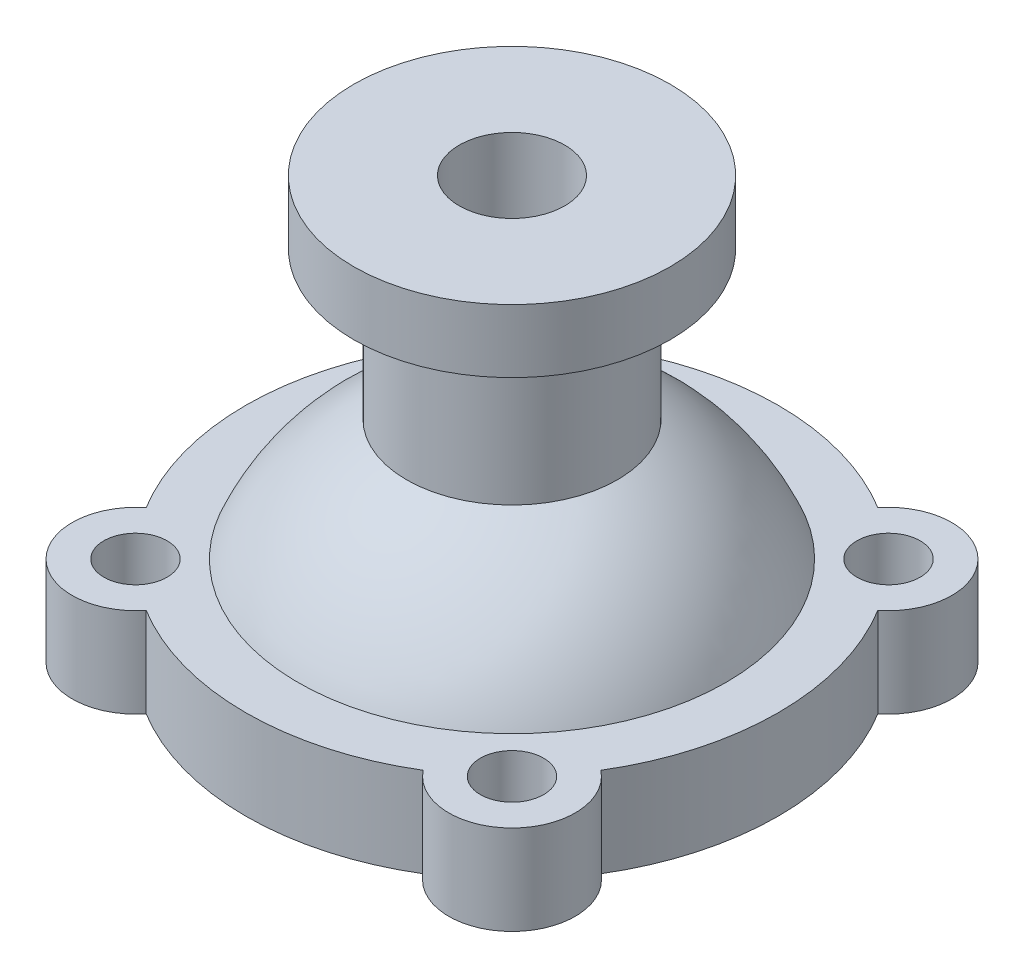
ISO-10303-21;
HEADER;
FILE_DESCRIPTION(('STEP AP214'),'2;1');
FILE_NAME('part.step','',(''),(''),'','','');
FILE_SCHEMA(('AUTOMOTIVE_DESIGN { 1 0 10303 214 1 1 1 1 }'));
ENDSEC;
DATA;
#1=APPLICATION_CONTEXT('core data for automotive mechanical design processes');
#2=APPLICATION_PROTOCOL_DEFINITION('international standard','automotive_design',2000,#1);
#3=PRODUCT_CONTEXT('',#1,'mechanical');
#4=PRODUCT('Part','Part','',(#3));
#5=PRODUCT_RELATED_PRODUCT_CATEGORY('part','',(#4));
#6=PRODUCT_DEFINITION_FORMATION('','',#4);
#7=PRODUCT_DEFINITION_CONTEXT('part definition',#1,'design');
#8=PRODUCT_DEFINITION('design','',#6,#7);
#9=PRODUCT_DEFINITION_SHAPE('','',#8);
#10=(LENGTH_UNIT() NAMED_UNIT(*) SI_UNIT(.MILLI.,.METRE.));
#11=(NAMED_UNIT(*) PLANE_ANGLE_UNIT() SI_UNIT($,.RADIAN.));
#12=(NAMED_UNIT(*) SI_UNIT($,.STERADIAN.) SOLID_ANGLE_UNIT());
#13=UNCERTAINTY_MEASURE_WITH_UNIT(LENGTH_MEASURE(1.E-05),#10,'distance_accuracy_value','');
#14=(GEOMETRIC_REPRESENTATION_CONTEXT(3) GLOBAL_UNCERTAINTY_ASSIGNED_CONTEXT((#13)) GLOBAL_UNIT_ASSIGNED_CONTEXT((#10,
#11,#12)) REPRESENTATION_CONTEXT('',''));
#15=CARTESIAN_POINT('',(0.,0.,0.));
#16=DIRECTION('',(0.,0.,1.));
#17=DIRECTION('',(1.,0.,0.));
#18=AXIS2_PLACEMENT_3D('',#15,#16,#17);
#19=CARTESIAN_POINT('',(0.,0.,0.));
#20=DIRECTION('',(0.,1.,0.));
#21=DIRECTION('',(1.,0.,0.));
#22=AXIS2_PLACEMENT_3D('',#19,#20,#21);
#23=SPHERICAL_SURFACE('',#22,88.);
#24=CARTESIAN_POINT('',(0.,34.,0.));
#25=DIRECTION('',(0.,1.,0.));
#26=DIRECTION('',(-1.,0.,0.));
#27=AXIS2_PLACEMENT_3D('',#24,#25,#26);
#28=CIRCLE('',#27,81.1664955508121);
#29=CARTESIAN_POINT('',(81.1664955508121,34.,0.));
#30=VERTEX_POINT('',#29);
#31=EDGE_CURVE('E204',#30,#30,#28,.T.);
#32=CARTESIAN_POINT('',(0.,80.,0.));
#33=DIRECTION('',(0.,1.,0.));
#34=DIRECTION('',(0.,0.,1.));
#35=AXIS2_PLACEMENT_3D('',#32,#33,#34);
#36=CIRCLE('',#35,36.6606055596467);
#37=CARTESIAN_POINT('',(36.6606055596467,80.,0.));
#38=VERTEX_POINT('',#37);
#39=EDGE_CURVE('E11',#38,#38,#36,.T.);
#40=CARTESIAN_POINT('',(81.1664955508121,34.,0.));
#41=CARTESIAN_POINT('',(80.9028514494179,34.6293883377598,0.));
#42=CARTESIAN_POINT('',(80.6318839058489,35.2557088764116,0.));
#43=CARTESIAN_POINT('',(80.0754547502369,36.5018781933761,0.));
#44=CARTESIAN_POINT('',(79.7899931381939,37.1217269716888,0.));
#45=CARTESIAN_POINT('',(79.2047286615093,38.354616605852,0.));
#46=CARTESIAN_POINT('',(78.9049257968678,38.9676574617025,0.));
#47=CARTESIAN_POINT('',(78.2911414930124,40.1865997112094,0.));
#48=CARTESIAN_POINT('',(77.9771600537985,40.7925011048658,0.));
#49=CARTESIAN_POINT('',(77.3351883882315,41.9968365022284,0.));
#50=CARTESIAN_POINT('',(77.0071981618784,42.5952705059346,0.));
#51=CARTESIAN_POINT('',(76.3373864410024,43.7843473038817,0.));
#52=CARTESIAN_POINT('',(75.9955649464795,44.3749900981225,0.));
#53=CARTESIAN_POINT('',(75.2982756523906,45.5481648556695,0.));
#54=CARTESIAN_POINT('',(74.9428078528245,46.1306968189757,0.));
#55=CARTESIAN_POINT('',(74.2184183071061,47.287334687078,0.));
#56=CARTESIAN_POINT('',(73.8494965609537,47.8614405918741,0.));
#57=CARTESIAN_POINT('',(73.098398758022,49.0009156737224,0.));
#58=CARTESIAN_POINT('',(72.7162227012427,49.5662848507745,0.));
#59=CARTESIAN_POINT('',(71.9388230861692,50.6879805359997,0.));
#60=CARTESIAN_POINT('',(71.5435995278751,51.2443070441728,0.));
#61=CARTESIAN_POINT('',(70.7403187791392,52.3476163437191,0.));
#62=CARTESIAN_POINT('',(70.3322615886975,52.8945991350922,0.));
#63=CARTESIAN_POINT('',(69.5035343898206,53.9789250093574,0.));
#64=CARTESIAN_POINT('',(69.0828643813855,54.5162680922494,0.));
#65=CARTESIAN_POINT('',(68.2291391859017,55.5810237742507,0.));
#66=CARTESIAN_POINT('',(67.7960839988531,56.1084363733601,0.));
#67=CARTESIAN_POINT('',(66.9178227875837,57.1530456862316,0.));
#68=CARTESIAN_POINT('',(66.4726167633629,57.6702423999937,0.));
#69=CARTESIAN_POINT('',(65.5702947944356,58.6941400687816,0.));
#70=CARTESIAN_POINT('',(65.1131788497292,59.2008410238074,0.));
#71=CARTESIAN_POINT('',(64.187284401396,60.2034729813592,0.));
#72=CARTESIAN_POINT('',(63.7185058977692,60.6994039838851,0.));
#73=CARTESIAN_POINT('',(62.7695400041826,61.6802276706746,0.));
#74=CARTESIAN_POINT('',(62.2893526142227,62.1651203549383,0.));
#75=CARTESIAN_POINT('',(61.3178287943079,63.1236050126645,0.));
#76=CARTESIAN_POINT('',(60.8264923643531,63.597196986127,0.));
#77=CARTESIAN_POINT('',(59.8329363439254,64.5328239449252,0.));
#78=CARTESIAN_POINT('',(59.3307167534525,64.9948589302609,0.));
#79=CARTESIAN_POINT('',(58.3156661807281,65.9071218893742,0.));
#80=CARTESIAN_POINT('',(57.8028351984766,66.3573498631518,0.));
#81=CARTESIAN_POINT('',(56.766839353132,67.2457551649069,0.));
#82=CARTESIAN_POINT('',(56.2436744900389,67.6839324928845,0.));
#83=CARTESIAN_POINT('',(55.187293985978,68.5479993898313,0.));
#84=CARTESIAN_POINT('',(54.6540783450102,68.9738889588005,0.));
#85=CARTESIAN_POINT('',(53.5778848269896,69.8131498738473,0.));
#86=CARTESIAN_POINT('',(53.0349069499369,70.226521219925,0.));
#87=CARTESIAN_POINT('',(51.9394827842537,71.0405219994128,0.));
#88=CARTESIAN_POINT('',(51.3870364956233,71.4411514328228,0.));
#89=CARTESIAN_POINT('',(50.2729744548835,72.2294515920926,0.));
#90=CARTESIAN_POINT('',(49.7113587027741,72.6171223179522,0.));
#91=CARTESIAN_POINT('',(48.5792616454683,73.3792952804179,0.));
#92=CARTESIAN_POINT('',(48.0087803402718,73.753797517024,0.));
#93=CARTESIAN_POINT('',(46.8592608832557,74.4894308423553,0.));
#94=CARTESIAN_POINT('',(46.2802227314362,74.8505619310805,0.));
#95=CARTESIAN_POINT('',(45.1139029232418,75.5592575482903,0.));
#96=CARTESIAN_POINT('',(44.526621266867,75.9068220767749,0.));
#97=CARTESIAN_POINT('',(43.3441322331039,76.5881964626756,0.));
#98=CARTESIAN_POINT('',(42.7489248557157,76.9220063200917,0.));
#99=CARTESIAN_POINT('',(41.5509065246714,77.5756908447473,0.));
#100=CARTESIAN_POINT('',(40.9480955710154,77.8955655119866,0.));
#101=CARTESIAN_POINT('',(39.7351960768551,78.5212061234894,0.));
#102=CARTESIAN_POINT('',(39.1251075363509,78.8269720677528,0.));
#103=CARTESIAN_POINT('',(37.8979838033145,79.424231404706,0.));
#104=CARTESIAN_POINT('',(37.2809486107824,79.7157247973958,0.));
#105=CARTESIAN_POINT('',(36.6606055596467,80.,0.));
#106=B_SPLINE_CURVE_WITH_KNOTS('',3,(#40,#41,#42,#43,#44,#45,#46,#47,#48,#49,#50,#51,#52,#53,
#54,#55,#56,#57,#58,#59,#60,#61,#62,#63,#64,#65,#66,#67,#68,#69,#70,#71,#72,#73,#74,#75,#76,#77,
#78,#79,#80,#81,#82,#83,#84,#85,#86,#87,#88,#89,#90,#91,#92,#93,#94,#95,#96,#97,#98,#99,#100,
#101,#102,#103,#104,#105),.UNSPECIFIED.,.F.,.F.,(4,2,2,2,2,2,2,2,2,2,2,2,2,2,2,2,2,2,2,2,2,2,2,
2,2,2,2,2,2,2,2,2,4),(0.,2.04708368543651,4.09416737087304,6.14125105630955,8.18833474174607,
10.2354184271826,12.2825021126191,14.3295857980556,16.3766694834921,18.4237531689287,
20.4708368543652,22.5179205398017,24.5650042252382,26.6120879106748,28.6591715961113,
30.7062552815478,32.7533389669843,34.8004226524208,36.8475063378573,38.8945900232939,
40.9416737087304,42.9887573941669,45.0358410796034,47.0829247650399,49.1300084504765,
51.177092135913,53.2241758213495,55.271259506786,57.3183431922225,59.3654268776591,
61.4125105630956,63.4595942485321,65.5066779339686),.UNSPECIFIED.);
#107=EDGE_CURVE('BSEAM31',#30,#38,#106,.T.);
#108=ORIENTED_EDGE('',*,*,#31,.T.);
#109=ORIENTED_EDGE('',*,*,#39,.F.);
#110=ORIENTED_EDGE('',*,*,#107,.T.);
#111=ORIENTED_EDGE('',*,*,#107,.F.);
#112=EDGE_LOOP('',(#108,#110,#109,#111));
#113=FACE_BOUND('',#112,.T.);
#114=ADVANCED_FACE('F31',(#113),#23,.T.);
#115=CARTESIAN_POINT('',(0.,0.,0.));
#116=DIRECTION('',(0.,1.,0.));
#117=DIRECTION('',(1.,0.,0.));
#118=AXIS2_PLACEMENT_3D('',#115,#116,#117);
#119=SPHERICAL_SURFACE('',#118,74.);
#120=CARTESIAN_POINT('',(0.,71.2460525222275,0.));
#121=DIRECTION('',(0.,-1.,0.));
#122=DIRECTION('',(0.,0.,-1.));
#123=AXIS2_PLACEMENT_3D('',#120,#121,#122);
#124=CIRCLE('',#123,20.);
#125=CARTESIAN_POINT('',(0.,71.2460525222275,-20.));
#126=VERTEX_POINT('',#125);
#127=EDGE_CURVE('E222',#126,#126,#124,.F.);
#128=ORIENTED_EDGE('',*,*,#127,.T.);
#129=EDGE_LOOP('',(#128));
#130=FACE_BOUND('',#129,.T.);
#131=CARTESIAN_POINT('',(0.,0.,0.));
#132=DIRECTION('',(0.,1.,0.));
#133=DIRECTION('',(0.,0.,1.));
#134=AXIS2_PLACEMENT_3D('',#131,#132,#133);
#135=CIRCLE('',#134,74.);
#136=CARTESIAN_POINT('',(0.,0.,74.));
#137=VERTEX_POINT('',#136);
#138=EDGE_CURVE('E209',#137,#137,#135,.T.);
#139=ORIENTED_EDGE('',*,*,#138,.F.);
#140=EDGE_LOOP('',(#139));
#141=FACE_BOUND('',#140,.T.);
#142=ADVANCED_FACE('F266',(#130,#141),#119,.F.);
#143=CARTESIAN_POINT('',(35.7088924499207,0.,-35.7088924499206));
#144=DIRECTION('',(0.,1.,0.));
#145=DIRECTION('',(0.,0.,1.));
#146=AXIS2_PLACEMENT_3D('',#143,#144,#145);
#147=PLANE('',#146);
#148=CARTESIAN_POINT('',(-71.4177848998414,0.,71.4177848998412));
#149=DIRECTION('',(0.,1.,0.));
#150=DIRECTION('',(0.,0.,1.));
#151=AXIS2_PLACEMENT_3D('',#148,#149,#150);
#152=CIRCLE('',#151,12.);
#153=CARTESIAN_POINT('',(-71.4177848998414,0.,83.4177848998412));
#154=VERTEX_POINT('',#153);
#155=EDGE_CURVE('E201',#154,#154,#152,.T.);
#156=ORIENTED_EDGE('',*,*,#155,.T.);
#157=EDGE_LOOP('',(#156));
#158=FACE_BOUND('',#157,.T.);
#159=CARTESIAN_POINT('',(71.4177848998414,0.,-71.4177848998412));
#160=DIRECTION('',(0.,1.,0.));
#161=DIRECTION('',(0.,0.,1.));
#162=AXIS2_PLACEMENT_3D('',#159,#160,#161);
#163=CIRCLE('',#162,12.);
#164=CARTESIAN_POINT('',(71.4177848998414,0.,-59.4177848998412));
#165=VERTEX_POINT('',#164);
#166=EDGE_CURVE('E189',#165,#165,#163,.T.);
#167=ORIENTED_EDGE('',*,*,#166,.T.);
#168=EDGE_LOOP('',(#167));
#169=FACE_BOUND('',#168,.T.);
#170=CARTESIAN_POINT('',(0.,0.,0.));
#171=DIRECTION('',(0.,1.,0.));
#172=DIRECTION('',(0.,0.,1.));
#173=AXIS2_PLACEMENT_3D('',#170,#171,#172);
#174=CIRCLE('',#173,101.);
#175=CARTESIAN_POINT('',(86.2518369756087,0.,52.5511238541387));
#176=VERTEX_POINT('',#175);
#177=CARTESIAN_POINT('',(86.2518369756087,0.,-52.5511238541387));
#178=VERTEX_POINT('',#177);
#179=EDGE_CURVE('E130',#176,#178,#174,.T.);
#180=ORIENTED_EDGE('',*,*,#179,.F.);
#181=CARTESIAN_POINT('',(71.4177848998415,0.,71.4177848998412));
#182=DIRECTION('',(0.,1.,0.));
#183=DIRECTION('',(0.,0.,1.));
#184=AXIS2_PLACEMENT_3D('',#181,#182,#183);
#185=CIRCLE('',#184,24.);
#186=CARTESIAN_POINT('',(52.551123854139,0.,86.2518369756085));
#187=VERTEX_POINT('',#186);
#188=EDGE_CURVE('E83',#187,#176,#185,.T.);
#189=ORIENTED_EDGE('',*,*,#188,.F.);
#190=CARTESIAN_POINT('',(0.,0.,0.));
#191=DIRECTION('',(0.,1.,0.));
#192=DIRECTION('',(0.,0.,1.));
#193=AXIS2_PLACEMENT_3D('',#190,#191,#192);
#194=CIRCLE('',#193,101.);
#195=CARTESIAN_POINT('',(-52.551123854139,0.,86.2518369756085));
#196=VERTEX_POINT('',#195);
#197=EDGE_CURVE('E77',#196,#187,#194,.T.);
#198=ORIENTED_EDGE('',*,*,#197,.F.);
#199=CARTESIAN_POINT('',(-71.4177848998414,0.,71.4177848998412));
#200=DIRECTION('',(0.,1.,0.));
#201=DIRECTION('',(0.,0.,1.));
#202=AXIS2_PLACEMENT_3D('',#199,#200,#201);
#203=CIRCLE('',#202,24.);
#204=CARTESIAN_POINT('',(-86.2518369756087,0.,52.5511238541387));
#205=VERTEX_POINT('',#204);
#206=EDGE_CURVE('E120',#205,#196,#203,.T.);
#207=ORIENTED_EDGE('',*,*,#206,.F.);
#208=CARTESIAN_POINT('',(0.,0.,0.));
#209=DIRECTION('',(0.,1.,0.));
#210=DIRECTION('',(0.,0.,1.));
#211=AXIS2_PLACEMENT_3D('',#208,#209,#210);
#212=CIRCLE('',#211,101.);
#213=CARTESIAN_POINT('',(-86.2518369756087,0.,-52.5511238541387));
#214=VERTEX_POINT('',#213);
#215=EDGE_CURVE('E140',#214,#205,#212,.T.);
#216=ORIENTED_EDGE('',*,*,#215,.F.);
#217=CARTESIAN_POINT('',(-71.4177848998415,0.,-71.4177848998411));
#218=DIRECTION('',(0.,1.,0.));
#219=DIRECTION('',(0.,0.,1.));
#220=AXIS2_PLACEMENT_3D('',#217,#218,#219);
#221=CIRCLE('',#220,24.);
#222=CARTESIAN_POINT('',(-52.5511238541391,0.,-86.2518369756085));
#223=VERTEX_POINT('',#222);
#224=EDGE_CURVE('E138',#223,#214,#221,.T.);
#225=ORIENTED_EDGE('',*,*,#224,.F.);
#226=CARTESIAN_POINT('',(0.,0.,0.));
#227=DIRECTION('',(0.,1.,0.));
#228=DIRECTION('',(0.,0.,1.));
#229=AXIS2_PLACEMENT_3D('',#226,#227,#228);
#230=CIRCLE('',#229,101.);
#231=CARTESIAN_POINT('',(52.551123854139,0.,-86.2518369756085));
#232=VERTEX_POINT('',#231);
#233=EDGE_CURVE('E136',#232,#223,#230,.T.);
#234=ORIENTED_EDGE('',*,*,#233,.F.);
#235=CARTESIAN_POINT('',(71.4177848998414,0.,-71.4177848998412));
#236=DIRECTION('',(0.,1.,0.));
#237=DIRECTION('',(0.,0.,1.));
#238=AXIS2_PLACEMENT_3D('',#235,#236,#237);
#239=CIRCLE('',#238,24.);
#240=EDGE_CURVE('E133',#178,#232,#239,.T.);
#241=ORIENTED_EDGE('',*,*,#240,.F.);
#242=EDGE_LOOP('',(#180,#189,#198,#207,#216,#225,#234,#241));
#243=FACE_BOUND('',#242,.T.);
#244=CARTESIAN_POINT('',(-71.4177848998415,0.,-71.4177848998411));
#245=DIRECTION('',(0.,1.,0.));
#246=DIRECTION('',(0.,0.,1.));
#247=AXIS2_PLACEMENT_3D('',#244,#245,#246);
#248=CIRCLE('',#247,12.);
#249=CARTESIAN_POINT('',(-71.4177848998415,0.,-59.4177848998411));
#250=VERTEX_POINT('',#249);
#251=EDGE_CURVE('E183',#250,#250,#248,.T.);
#252=ORIENTED_EDGE('',*,*,#251,.T.);
#253=EDGE_LOOP('',(#252));
#254=FACE_BOUND('',#253,.T.);
#255=CARTESIAN_POINT('',(71.4177848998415,0.,71.4177848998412));
#256=DIRECTION('',(0.,1.,0.));
#257=DIRECTION('',(0.,0.,1.));
#258=AXIS2_PLACEMENT_3D('',#255,#256,#257);
#259=CIRCLE('',#258,12.);
#260=CARTESIAN_POINT('',(71.4177848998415,0.,83.4177848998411));
#261=VERTEX_POINT('',#260);
#262=EDGE_CURVE('E195',#261,#261,#259,.T.);
#263=ORIENTED_EDGE('',*,*,#262,.T.);
#264=EDGE_LOOP('',(#263));
#265=FACE_BOUND('',#264,.T.);
#266=ORIENTED_EDGE('',*,*,#138,.T.);
#267=EDGE_LOOP('',(#266));
#268=FACE_BOUND('',#267,.T.);
#269=ADVANCED_FACE('F163',(#158,#169,#243,#254,#265,#268),#147,.F.);
#270=CARTESIAN_POINT('',(35.7088924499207,34.,-35.7088924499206));
#271=DIRECTION('',(0.,1.,0.));
#272=DIRECTION('',(0.,0.,1.));
#273=AXIS2_PLACEMENT_3D('',#270,#271,#272);
#274=PLANE('',#273);
#275=CARTESIAN_POINT('',(-71.4177848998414,34.,71.4177848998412));
#276=DIRECTION('',(0.,1.,0.));
#277=DIRECTION('',(0.,0.,1.));
#278=AXIS2_PLACEMENT_3D('',#275,#276,#277);
#279=CIRCLE('',#278,12.);
#280=CARTESIAN_POINT('',(-71.4177848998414,34.,83.4177848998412));
#281=VERTEX_POINT('',#280);
#282=EDGE_CURVE('E198',#281,#281,#279,.T.);
#283=ORIENTED_EDGE('',*,*,#282,.F.);
#284=EDGE_LOOP('',(#283));
#285=FACE_BOUND('',#284,.T.);
#286=CARTESIAN_POINT('',(71.4177848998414,34.,-71.4177848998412));
#287=DIRECTION('',(0.,1.,0.));
#288=DIRECTION('',(0.,0.,1.));
#289=AXIS2_PLACEMENT_3D('',#286,#287,#288);
#290=CIRCLE('',#289,12.);
#291=CARTESIAN_POINT('',(71.4177848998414,34.,-59.4177848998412));
#292=VERTEX_POINT('',#291);
#293=EDGE_CURVE('E186',#292,#292,#290,.T.);
#294=ORIENTED_EDGE('',*,*,#293,.F.);
#295=EDGE_LOOP('',(#294));
#296=FACE_BOUND('',#295,.T.);
#297=CARTESIAN_POINT('',(0.,34.,0.));
#298=DIRECTION('',(0.,1.,0.));
#299=DIRECTION('',(0.,0.,1.));
#300=AXIS2_PLACEMENT_3D('',#297,#298,#299);
#301=CIRCLE('',#300,101.);
#302=CARTESIAN_POINT('',(86.2518369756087,34.,52.5511238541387));
#303=VERTEX_POINT('',#302);
#304=CARTESIAN_POINT('',(86.2518369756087,34.,-52.5511238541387));
#305=VERTEX_POINT('',#304);
#306=EDGE_CURVE('E145',#303,#305,#301,.T.);
#307=ORIENTED_EDGE('',*,*,#306,.T.);
#308=CARTESIAN_POINT('',(71.4177848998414,34.,-71.4177848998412));
#309=DIRECTION('',(0.,1.,0.));
#310=DIRECTION('',(0.,0.,1.));
#311=AXIS2_PLACEMENT_3D('',#308,#309,#310);
#312=CIRCLE('',#311,24.);
#313=CARTESIAN_POINT('',(52.551123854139,34.,-86.2518369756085));
#314=VERTEX_POINT('',#313);
#315=EDGE_CURVE('E92',#305,#314,#312,.T.);
#316=ORIENTED_EDGE('',*,*,#315,.T.);
#317=CARTESIAN_POINT('',(0.,34.,0.));
#318=DIRECTION('',(0.,1.,0.));
#319=DIRECTION('',(0.,0.,1.));
#320=AXIS2_PLACEMENT_3D('',#317,#318,#319);
#321=CIRCLE('',#320,101.);
#322=CARTESIAN_POINT('',(-52.5511238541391,34.,-86.2518369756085));
#323=VERTEX_POINT('',#322);
#324=EDGE_CURVE('E177',#314,#323,#321,.T.);
#325=ORIENTED_EDGE('',*,*,#324,.T.);
#326=CARTESIAN_POINT('',(-71.4177848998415,34.,-71.4177848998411));
#327=DIRECTION('',(0.,1.,0.));
#328=DIRECTION('',(0.,0.,1.));
#329=AXIS2_PLACEMENT_3D('',#326,#327,#328);
#330=CIRCLE('',#329,24.);
#331=CARTESIAN_POINT('',(-86.2518369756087,34.,-52.5511238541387));
#332=VERTEX_POINT('',#331);
#333=EDGE_CURVE('E176',#323,#332,#330,.T.);
#334=ORIENTED_EDGE('',*,*,#333,.T.);
#335=CARTESIAN_POINT('',(0.,34.,0.));
#336=DIRECTION('',(0.,1.,0.));
#337=DIRECTION('',(0.,0.,1.));
#338=AXIS2_PLACEMENT_3D('',#335,#336,#337);
#339=CIRCLE('',#338,101.);
#340=CARTESIAN_POINT('',(-86.2518369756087,34.,52.5511238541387));
#341=VERTEX_POINT('',#340);
#342=EDGE_CURVE('E112',#332,#341,#339,.T.);
#343=ORIENTED_EDGE('',*,*,#342,.T.);
#344=CARTESIAN_POINT('',(-71.4177848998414,34.,71.4177848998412));
#345=DIRECTION('',(0.,1.,0.));
#346=DIRECTION('',(0.,0.,1.));
#347=AXIS2_PLACEMENT_3D('',#344,#345,#346);
#348=CIRCLE('',#347,24.);
#349=CARTESIAN_POINT('',(-52.551123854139,34.,86.2518369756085));
#350=VERTEX_POINT('',#349);
#351=EDGE_CURVE('E105',#341,#350,#348,.T.);
#352=ORIENTED_EDGE('',*,*,#351,.T.);
#353=CARTESIAN_POINT('',(0.,34.,0.));
#354=DIRECTION('',(0.,1.,0.));
#355=DIRECTION('',(0.,0.,1.));
#356=AXIS2_PLACEMENT_3D('',#353,#354,#355);
#357=CIRCLE('',#356,101.);
#358=CARTESIAN_POINT('',(52.551123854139,34.,86.2518369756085));
#359=VERTEX_POINT('',#358);
#360=EDGE_CURVE('E110',#350,#359,#357,.T.);
#361=ORIENTED_EDGE('',*,*,#360,.T.);
#362=CARTESIAN_POINT('',(71.4177848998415,34.,71.4177848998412));
#363=DIRECTION('',(0.,1.,0.));
#364=DIRECTION('',(0.,0.,1.));
#365=AXIS2_PLACEMENT_3D('',#362,#363,#364);
#366=CIRCLE('',#365,24.);
#367=EDGE_CURVE('E48',#359,#303,#366,.T.);
#368=ORIENTED_EDGE('',*,*,#367,.T.);
#369=EDGE_LOOP('',(#307,#316,#325,#334,#343,#352,#361,#368));
#370=FACE_BOUND('',#369,.T.);
#371=CARTESIAN_POINT('',(-71.4177848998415,34.,-71.4177848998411));
#372=DIRECTION('',(0.,1.,0.));
#373=DIRECTION('',(0.,0.,1.));
#374=AXIS2_PLACEMENT_3D('',#371,#372,#373);
#375=CIRCLE('',#374,12.);
#376=CARTESIAN_POINT('',(-71.4177848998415,34.,-59.4177848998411));
#377=VERTEX_POINT('',#376);
#378=EDGE_CURVE('E134',#377,#377,#375,.T.);
#379=ORIENTED_EDGE('',*,*,#378,.F.);
#380=EDGE_LOOP('',(#379));
#381=FACE_BOUND('',#380,.T.);
#382=CARTESIAN_POINT('',(71.4177848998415,34.,71.4177848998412));
#383=DIRECTION('',(0.,1.,0.));
#384=DIRECTION('',(0.,0.,1.));
#385=AXIS2_PLACEMENT_3D('',#382,#383,#384);
#386=CIRCLE('',#385,12.);
#387=CARTESIAN_POINT('',(71.4177848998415,34.,83.4177848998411));
#388=VERTEX_POINT('',#387);
#389=EDGE_CURVE('E192',#388,#388,#386,.T.);
#390=ORIENTED_EDGE('',*,*,#389,.F.);
#391=EDGE_LOOP('',(#390));
#392=FACE_BOUND('',#391,.T.);
#393=ORIENTED_EDGE('',*,*,#31,.F.);
#394=EDGE_LOOP('',(#393));
#395=FACE_BOUND('',#394,.T.);
#396=ADVANCED_FACE('F107',(#285,#296,#370,#381,#392,#395),#274,.T.);
#397=CARTESIAN_POINT('',(0.,34.,0.));
#398=DIRECTION('',(0.,-1.,0.));
#399=DIRECTION('',(0.,0.,-1.));
#400=AXIS2_PLACEMENT_3D('',#397,#398,#399);
#401=CYLINDRICAL_SURFACE('',#400,101.);
#402=ORIENTED_EDGE('',*,*,#179,.T.);
#403=DIRECTION('',(0.,-1.,0.));
#404=VECTOR('',#403,1.);
#405=CARTESIAN_POINT('',(86.2518369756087,34.,-52.5511238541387));
#406=LINE('',#405,#404);
#407=EDGE_CURVE('E40',#305,#178,#406,.T.);
#408=ORIENTED_EDGE('',*,*,#407,.F.);
#409=ORIENTED_EDGE('',*,*,#306,.F.);
#410=DIRECTION('',(0.,-1.,0.));
#411=VECTOR('',#410,1.);
#412=CARTESIAN_POINT('',(86.2518369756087,34.,52.5511238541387));
#413=LINE('',#412,#411);
#414=EDGE_CURVE('E126',#303,#176,#413,.T.);
#415=ORIENTED_EDGE('',*,*,#414,.T.);
#416=EDGE_LOOP('',(#402,#408,#409,#415));
#417=FACE_BOUND('',#416,.T.);
#418=ADVANCED_FACE('F33',(#417),#401,.T.);
#419=CARTESIAN_POINT('',(71.4177848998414,34.,-71.4177848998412));
#420=DIRECTION('',(0.,-1.,0.));
#421=DIRECTION('',(0.,0.,-1.));
#422=AXIS2_PLACEMENT_3D('',#419,#420,#421);
#423=CYLINDRICAL_SURFACE('',#422,24.);
#424=ORIENTED_EDGE('',*,*,#240,.T.);
#425=DIRECTION('',(0.,-1.,0.));
#426=VECTOR('',#425,1.);
#427=CARTESIAN_POINT('',(52.551123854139,34.,-86.2518369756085));
#428=LINE('',#427,#426);
#429=EDGE_CURVE('E155',#314,#232,#428,.T.);
#430=ORIENTED_EDGE('',*,*,#429,.F.);
#431=ORIENTED_EDGE('',*,*,#315,.F.);
#432=ORIENTED_EDGE('',*,*,#407,.T.);
#433=EDGE_LOOP('',(#424,#430,#431,#432));
#434=FACE_BOUND('',#433,.T.);
#435=ADVANCED_FACE('F158',(#434),#423,.T.);
#436=CARTESIAN_POINT('',(0.,34.,0.));
#437=DIRECTION('',(0.,-1.,0.));
#438=DIRECTION('',(0.,0.,-1.));
#439=AXIS2_PLACEMENT_3D('',#436,#437,#438);
#440=CYLINDRICAL_SURFACE('',#439,101.);
#441=ORIENTED_EDGE('',*,*,#233,.T.);
#442=DIRECTION('',(0.,-1.,0.));
#443=VECTOR('',#442,1.);
#444=CARTESIAN_POINT('',(-52.5511238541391,34.,-86.2518369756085));
#445=LINE('',#444,#443);
#446=EDGE_CURVE('E152',#323,#223,#445,.T.);
#447=ORIENTED_EDGE('',*,*,#446,.F.);
#448=ORIENTED_EDGE('',*,*,#324,.F.);
#449=ORIENTED_EDGE('',*,*,#429,.T.);
#450=EDGE_LOOP('',(#441,#447,#448,#449));
#451=FACE_BOUND('',#450,.T.);
#452=ADVANCED_FACE('F170',(#451),#440,.T.);
#453=CARTESIAN_POINT('',(-71.4177848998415,34.,-71.4177848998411));
#454=DIRECTION('',(0.,-1.,0.));
#455=DIRECTION('',(0.,0.,-1.));
#456=AXIS2_PLACEMENT_3D('',#453,#454,#455);
#457=CYLINDRICAL_SURFACE('',#456,24.);
#458=ORIENTED_EDGE('',*,*,#224,.T.);
#459=DIRECTION('',(0.,-1.,0.));
#460=VECTOR('',#459,1.);
#461=CARTESIAN_POINT('',(-86.2518369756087,34.,-52.5511238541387));
#462=LINE('',#461,#460);
#463=EDGE_CURVE('E149',#332,#214,#462,.T.);
#464=ORIENTED_EDGE('',*,*,#463,.F.);
#465=ORIENTED_EDGE('',*,*,#333,.F.);
#466=ORIENTED_EDGE('',*,*,#446,.T.);
#467=EDGE_LOOP('',(#458,#464,#465,#466));
#468=FACE_BOUND('',#467,.T.);
#469=ADVANCED_FACE('F174',(#468),#457,.T.);
#470=CARTESIAN_POINT('',(0.,34.,0.));
#471=DIRECTION('',(0.,-1.,0.));
#472=DIRECTION('',(0.,0.,-1.));
#473=AXIS2_PLACEMENT_3D('',#470,#471,#472);
#474=CYLINDRICAL_SURFACE('',#473,101.);
#475=ORIENTED_EDGE('',*,*,#215,.T.);
#476=DIRECTION('',(0.,-1.,0.));
#477=VECTOR('',#476,1.);
#478=CARTESIAN_POINT('',(-86.2518369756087,34.,52.5511238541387));
#479=LINE('',#478,#477);
#480=EDGE_CURVE('E121',#341,#205,#479,.T.);
#481=ORIENTED_EDGE('',*,*,#480,.F.);
#482=ORIENTED_EDGE('',*,*,#342,.F.);
#483=ORIENTED_EDGE('',*,*,#463,.T.);
#484=EDGE_LOOP('',(#475,#481,#482,#483));
#485=FACE_BOUND('',#484,.T.);
#486=ADVANCED_FACE('F303',(#485),#474,.T.);
#487=CARTESIAN_POINT('',(-71.4177848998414,34.,71.4177848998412));
#488=DIRECTION('',(0.,-1.,0.));
#489=DIRECTION('',(0.,0.,-1.));
#490=AXIS2_PLACEMENT_3D('',#487,#488,#489);
#491=CYLINDRICAL_SURFACE('',#490,24.);
#492=ORIENTED_EDGE('',*,*,#206,.T.);
#493=DIRECTION('',(0.,-1.,0.));
#494=VECTOR('',#493,1.);
#495=CARTESIAN_POINT('',(-52.551123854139,34.,86.2518369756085));
#496=LINE('',#495,#494);
#497=EDGE_CURVE('E117',#350,#196,#496,.T.);
#498=ORIENTED_EDGE('',*,*,#497,.F.);
#499=ORIENTED_EDGE('',*,*,#351,.F.);
#500=ORIENTED_EDGE('',*,*,#480,.T.);
#501=EDGE_LOOP('',(#492,#498,#499,#500));
#502=FACE_BOUND('',#501,.T.);
#503=ADVANCED_FACE('F118',(#502),#491,.T.);
#504=CARTESIAN_POINT('',(0.,34.,0.));
#505=DIRECTION('',(0.,-1.,0.));
#506=DIRECTION('',(0.,0.,-1.));
#507=AXIS2_PLACEMENT_3D('',#504,#505,#506);
#508=CYLINDRICAL_SURFACE('',#507,101.);
#509=ORIENTED_EDGE('',*,*,#197,.T.);
#510=DIRECTION('',(0.,-1.,0.));
#511=VECTOR('',#510,1.);
#512=CARTESIAN_POINT('',(52.551123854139,34.,86.2518369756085));
#513=LINE('',#512,#511);
#514=EDGE_CURVE('E122',#359,#187,#513,.T.);
#515=ORIENTED_EDGE('',*,*,#514,.F.);
#516=ORIENTED_EDGE('',*,*,#360,.F.);
#517=ORIENTED_EDGE('',*,*,#497,.T.);
#518=EDGE_LOOP('',(#509,#515,#516,#517));
#519=FACE_BOUND('',#518,.T.);
#520=ADVANCED_FACE('F124',(#519),#508,.T.);
#521=CARTESIAN_POINT('',(71.4177848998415,34.,71.4177848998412));
#522=DIRECTION('',(0.,-1.,0.));
#523=DIRECTION('',(0.,0.,-1.));
#524=AXIS2_PLACEMENT_3D('',#521,#522,#523);
#525=CYLINDRICAL_SURFACE('',#524,24.);
#526=ORIENTED_EDGE('',*,*,#188,.T.);
#527=ORIENTED_EDGE('',*,*,#414,.F.);
#528=ORIENTED_EDGE('',*,*,#367,.F.);
#529=ORIENTED_EDGE('',*,*,#514,.T.);
#530=EDGE_LOOP('',(#526,#527,#528,#529));
#531=FACE_BOUND('',#530,.T.);
#532=ADVANCED_FACE('F289',(#531),#525,.T.);
#533=CARTESIAN_POINT('',(-71.4177848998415,34.,-71.4177848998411));
#534=DIRECTION('',(0.,-1.,0.));
#535=DIRECTION('',(0.,0.,-1.));
#536=AXIS2_PLACEMENT_3D('',#533,#534,#535);
#537=CYLINDRICAL_SURFACE('',#536,12.);
#538=ORIENTED_EDGE('',*,*,#378,.T.);
#539=EDGE_LOOP('',(#538));
#540=FACE_BOUND('',#539,.T.);
#541=ORIENTED_EDGE('',*,*,#251,.F.);
#542=EDGE_LOOP('',(#541));
#543=FACE_BOUND('',#542,.T.);
#544=ADVANCED_FACE('F285',(#540,#543),#537,.F.);
#545=CARTESIAN_POINT('',(71.4177848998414,34.,-71.4177848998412));
#546=DIRECTION('',(0.,-1.,0.));
#547=DIRECTION('',(0.,0.,-1.));
#548=AXIS2_PLACEMENT_3D('',#545,#546,#547);
#549=CYLINDRICAL_SURFACE('',#548,12.);
#550=ORIENTED_EDGE('',*,*,#293,.T.);
#551=EDGE_LOOP('',(#550));
#552=FACE_BOUND('',#551,.T.);
#553=ORIENTED_EDGE('',*,*,#166,.F.);
#554=EDGE_LOOP('',(#553));
#555=FACE_BOUND('',#554,.T.);
#556=ADVANCED_FACE('F281',(#552,#555),#549,.F.);
#557=CARTESIAN_POINT('',(71.4177848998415,34.,71.4177848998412));
#558=DIRECTION('',(0.,-1.,0.));
#559=DIRECTION('',(0.,0.,-1.));
#560=AXIS2_PLACEMENT_3D('',#557,#558,#559);
#561=CYLINDRICAL_SURFACE('',#560,12.);
#562=ORIENTED_EDGE('',*,*,#389,.T.);
#563=EDGE_LOOP('',(#562));
#564=FACE_BOUND('',#563,.T.);
#565=ORIENTED_EDGE('',*,*,#262,.F.);
#566=EDGE_LOOP('',(#565));
#567=FACE_BOUND('',#566,.T.);
#568=ADVANCED_FACE('F277',(#564,#567),#561,.F.);
#569=CARTESIAN_POINT('',(-71.4177848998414,34.,71.4177848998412));
#570=DIRECTION('',(0.,-1.,0.));
#571=DIRECTION('',(0.,0.,-1.));
#572=AXIS2_PLACEMENT_3D('',#569,#570,#571);
#573=CYLINDRICAL_SURFACE('',#572,12.);
#574=ORIENTED_EDGE('',*,*,#282,.T.);
#575=EDGE_LOOP('',(#574));
#576=FACE_BOUND('',#575,.T.);
#577=ORIENTED_EDGE('',*,*,#155,.F.);
#578=EDGE_LOOP('',(#577));
#579=FACE_BOUND('',#578,.T.);
#580=ADVANCED_FACE('F261',(#576,#579),#573,.F.);
#581=CARTESIAN_POINT('',(0.,80.,0.));
#582=DIRECTION('',(0.,1.,0.));
#583=DIRECTION('',(0.,0.,1.));
#584=AXIS2_PLACEMENT_3D('',#581,#582,#583);
#585=PLANE('',#584);
#586=CARTESIAN_POINT('',(0.,80.,0.));
#587=DIRECTION('',(0.,1.,0.));
#588=DIRECTION('',(0.,0.,1.));
#589=AXIS2_PLACEMENT_3D('',#586,#587,#588);
#590=CIRCLE('',#589,40.);
#591=CARTESIAN_POINT('',(0.,80.,40.));
#592=VERTEX_POINT('',#591);
#593=EDGE_CURVE('E213',#592,#592,#590,.T.);
#594=ORIENTED_EDGE('',*,*,#593,.F.);
#595=EDGE_LOOP('',(#594));
#596=FACE_BOUND('',#595,.T.);
#597=ORIENTED_EDGE('',*,*,#39,.T.);
#598=EDGE_LOOP('',(#597));
#599=FACE_BOUND('',#598,.T.);
#600=ADVANCED_FACE('F255',(#596,#599),#585,.F.);
#601=CARTESIAN_POINT('',(0.,136.,0.));
#602=DIRECTION('',(0.,-1.,0.));
#603=DIRECTION('',(0.,0.,-1.));
#604=AXIS2_PLACEMENT_3D('',#601,#602,#603);
#605=CYLINDRICAL_SURFACE('',#604,40.);
#606=CARTESIAN_POINT('',(0.,136.,0.));
#607=DIRECTION('',(0.,1.,0.));
#608=DIRECTION('',(0.,0.,1.));
#609=AXIS2_PLACEMENT_3D('',#606,#607,#608);
#610=CIRCLE('',#609,40.);
#611=CARTESIAN_POINT('',(0.,136.,40.));
#612=VERTEX_POINT('',#611);
#613=EDGE_CURVE('E212',#612,#612,#610,.T.);
#614=ORIENTED_EDGE('',*,*,#613,.F.);
#615=EDGE_LOOP('',(#614));
#616=FACE_BOUND('',#615,.T.);
#617=ORIENTED_EDGE('',*,*,#593,.T.);
#618=EDGE_LOOP('',(#617));
#619=FACE_BOUND('',#618,.T.);
#620=ADVANCED_FACE('F249',(#616,#619),#605,.T.);
#621=CARTESIAN_POINT('',(0.,136.,0.));
#622=DIRECTION('',(0.,1.,0.));
#623=DIRECTION('',(0.,0.,1.));
#624=AXIS2_PLACEMENT_3D('',#621,#622,#623);
#625=PLANE('',#624);
#626=CARTESIAN_POINT('',(0.,136.,0.));
#627=DIRECTION('',(0.,1.,0.));
#628=DIRECTION('',(0.,0.,1.));
#629=AXIS2_PLACEMENT_3D('',#626,#627,#628);
#630=CIRCLE('',#629,60.);
#631=CARTESIAN_POINT('',(0.,136.,60.));
#632=VERTEX_POINT('',#631);
#633=EDGE_CURVE('E219',#632,#632,#630,.T.);
#634=ORIENTED_EDGE('',*,*,#633,.F.);
#635=EDGE_LOOP('',(#634));
#636=FACE_BOUND('',#635,.T.);
#637=ORIENTED_EDGE('',*,*,#613,.T.);
#638=EDGE_LOOP('',(#637));
#639=FACE_BOUND('',#638,.T.);
#640=ADVANCED_FACE('F243',(#636,#639),#625,.F.);
#641=CARTESIAN_POINT('',(0.,160.,0.));
#642=DIRECTION('',(0.,-1.,0.));
#643=DIRECTION('',(0.,0.,-1.));
#644=AXIS2_PLACEMENT_3D('',#641,#642,#643);
#645=CYLINDRICAL_SURFACE('',#644,60.);
#646=CARTESIAN_POINT('',(0.,160.,0.));
#647=DIRECTION('',(0.,1.,0.));
#648=DIRECTION('',(0.,0.,1.));
#649=AXIS2_PLACEMENT_3D('',#646,#647,#648);
#650=CIRCLE('',#649,60.);
#651=CARTESIAN_POINT('',(0.,160.,60.));
#652=VERTEX_POINT('',#651);
#653=EDGE_CURVE('E216',#652,#652,#650,.T.);
#654=ORIENTED_EDGE('',*,*,#653,.F.);
#655=EDGE_LOOP('',(#654));
#656=FACE_BOUND('',#655,.T.);
#657=ORIENTED_EDGE('',*,*,#633,.T.);
#658=EDGE_LOOP('',(#657));
#659=FACE_BOUND('',#658,.T.);
#660=ADVANCED_FACE('F237',(#656,#659),#645,.T.);
#661=CARTESIAN_POINT('',(0.,160.,0.));
#662=DIRECTION('',(0.,1.,0.));
#663=DIRECTION('',(0.,0.,1.));
#664=AXIS2_PLACEMENT_3D('',#661,#662,#663);
#665=PLANE('',#664);
#666=CARTESIAN_POINT('',(0.,160.,0.));
#667=DIRECTION('',(0.,1.,0.));
#668=DIRECTION('',(0.,0.,1.));
#669=AXIS2_PLACEMENT_3D('',#666,#667,#668);
#670=CIRCLE('',#669,20.);
#671=CARTESIAN_POINT('',(0.,160.,20.));
#672=VERTEX_POINT('',#671);
#673=EDGE_CURVE('E227',#672,#672,#670,.T.);
#674=ORIENTED_EDGE('',*,*,#673,.F.);
#675=EDGE_LOOP('',(#674));
#676=FACE_BOUND('',#675,.T.);
#677=ORIENTED_EDGE('',*,*,#653,.T.);
#678=EDGE_LOOP('',(#677));
#679=FACE_BOUND('',#678,.T.);
#680=ADVANCED_FACE('F234',(#676,#679),#665,.T.);
#681=CARTESIAN_POINT('',(0.,0.,0.));
#682=DIRECTION('',(0.,1.,0.));
#683=DIRECTION('',(0.,0.,1.));
#684=AXIS2_PLACEMENT_3D('',#681,#682,#683);
#685=CYLINDRICAL_SURFACE('',#684,20.);
#686=ORIENTED_EDGE('',*,*,#673,.T.);
#687=EDGE_LOOP('',(#686));
#688=FACE_BOUND('',#687,.T.);
#689=ORIENTED_EDGE('',*,*,#127,.F.);
#690=EDGE_LOOP('',(#689));
#691=FACE_BOUND('',#690,.T.);
#692=ADVANCED_FACE('F231',(#688,#691),#685,.F.);
#693=CLOSED_SHELL('',(#114,#142,#269,#396,#418,#435,#452,#469,#486,#503,#520,#532,#544,#556,
#568,#580,#600,#620,#640,#660,#680,#692));
#694=MANIFOLD_SOLID_BREP('B2',#693);
#695=ADVANCED_BREP_SHAPE_REPRESENTATION('',(#18,#694),#14);
#696=SHAPE_DEFINITION_REPRESENTATION(#9,#695);
ENDSEC;
END-ISO-10303-21;
